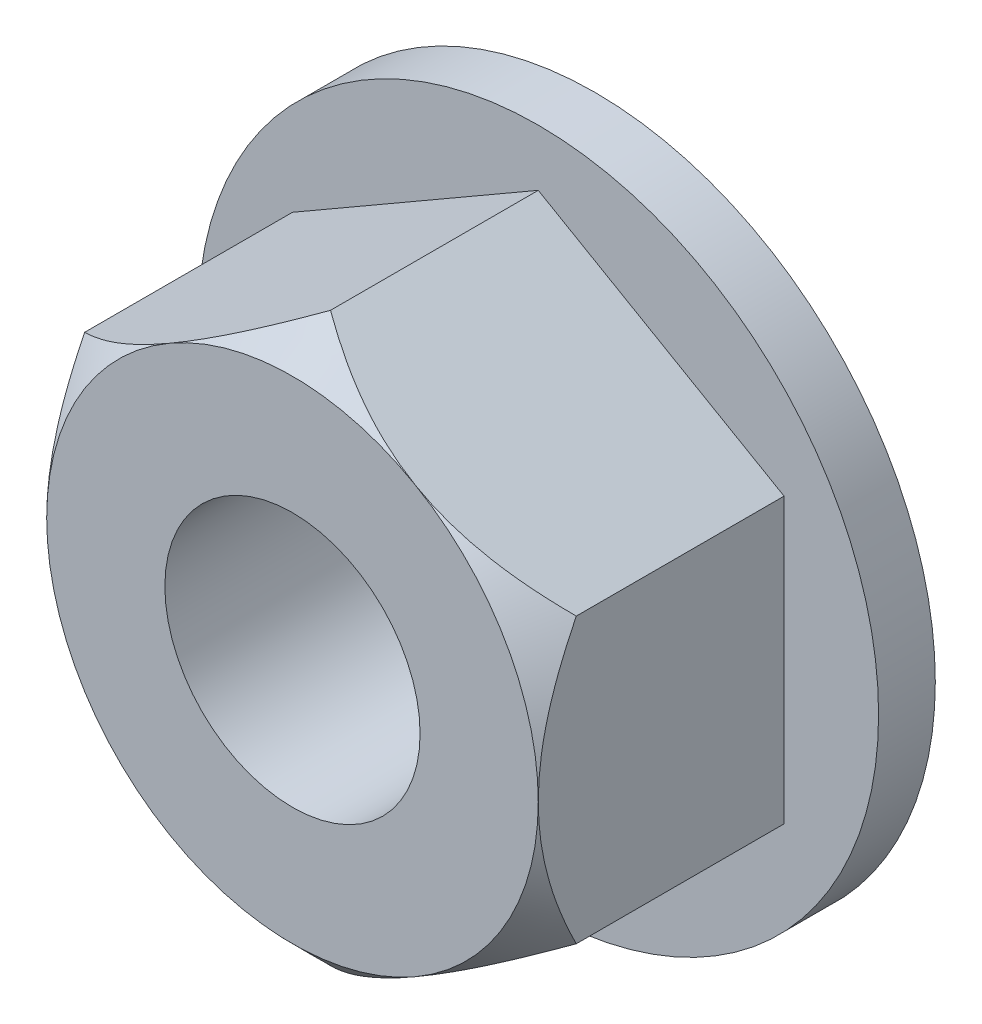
ISO-10303-21;
HEADER;
FILE_DESCRIPTION(('STEP AP214'),'2;1');
FILE_NAME('part.step','',(''),(''),'','','');
FILE_SCHEMA(('AUTOMOTIVE_DESIGN { 1 0 10303 214 1 1 1 1 }'));
ENDSEC;
DATA;
#1=APPLICATION_CONTEXT('core data for automotive mechanical design processes');
#2=APPLICATION_PROTOCOL_DEFINITION('international standard','automotive_design',2000,#1);
#3=PRODUCT_CONTEXT('',#1,'mechanical');
#4=PRODUCT('Part','Part','',(#3));
#5=PRODUCT_RELATED_PRODUCT_CATEGORY('part','',(#4));
#6=PRODUCT_DEFINITION_FORMATION('','',#4);
#7=PRODUCT_DEFINITION_CONTEXT('part definition',#1,'design');
#8=PRODUCT_DEFINITION('design','',#6,#7);
#9=PRODUCT_DEFINITION_SHAPE('','',#8);
#10=(LENGTH_UNIT() NAMED_UNIT(*) SI_UNIT(.MILLI.,.METRE.));
#11=(NAMED_UNIT(*) PLANE_ANGLE_UNIT() SI_UNIT($,.RADIAN.));
#12=(NAMED_UNIT(*) SI_UNIT($,.STERADIAN.) SOLID_ANGLE_UNIT());
#13=UNCERTAINTY_MEASURE_WITH_UNIT(LENGTH_MEASURE(1.E-05),#10,'distance_accuracy_value','');
#14=(GEOMETRIC_REPRESENTATION_CONTEXT(3) GLOBAL_UNCERTAINTY_ASSIGNED_CONTEXT((#13)) GLOBAL_UNIT_ASSIGNED_CONTEXT((#10,
#11,#12)) REPRESENTATION_CONTEXT('',''));
#15=CARTESIAN_POINT('',(0.,0.,0.));
#16=DIRECTION('',(0.,0.,1.));
#17=DIRECTION('',(1.,0.,0.));
#18=AXIS2_PLACEMENT_3D('',#15,#16,#17);
#19=CARTESIAN_POINT('',(-6.5,3.752776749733,0.));
#20=DIRECTION('',(-1.,0.,0.));
#21=DIRECTION('',(0.,0.,1.));
#22=AXIS2_PLACEMENT_3D('',#19,#20,#21);
#23=PLANE('',#22);
#24=DIRECTION('',(0.,0.,1.));
#25=VECTOR('',#24,1.);
#26=CARTESIAN_POINT('',(-6.49999999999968,3.75277674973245,0.));
#27=LINE('',#26,#25);
#28=CARTESIAN_POINT('',(-6.4999999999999,3.75277674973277,1.5));
#29=VERTEX_POINT('',#28);
#30=CARTESIAN_POINT('',(-6.49999996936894,3.75277676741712,6.99444651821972));
#31=VERTEX_POINT('',#30);
#32=EDGE_CURVE('E116',#29,#31,#27,.T.);
#33=ORIENTED_EDGE('',*,*,#32,.F.);
#34=DIRECTION('',(0.,1.,0.));
#35=VECTOR('',#34,1.);
#36=CARTESIAN_POINT('',(-6.5,0.,1.5));
#37=LINE('',#36,#35);
#38=CARTESIAN_POINT('',(-6.5,-3.752776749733,1.5));
#39=VERTEX_POINT('',#38);
#40=EDGE_CURVE('E94',#39,#29,#37,.T.);
#41=ORIENTED_EDGE('',*,*,#40,.F.);
#42=DIRECTION('',(0.,0.,1.));
#43=VECTOR('',#42,1.);
#44=CARTESIAN_POINT('',(-6.5,-3.752776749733,0.));
#45=LINE('',#44,#43);
#46=CARTESIAN_POINT('',(-6.5,-3.75277671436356,6.99444651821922));
#47=VERTEX_POINT('',#46);
#48=EDGE_CURVE('E101',#47,#39,#45,.F.);
#49=ORIENTED_EDGE('',*,*,#48,.F.);
#50=CARTESIAN_POINT('',(-6.5,7.14982880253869E-09,8.00000000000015));
#51=CARTESIAN_POINT('',(-6.5,-0.0998256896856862,8.00001159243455));
#52=CARTESIAN_POINT('',(-6.5,-0.199647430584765,7.99770065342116));
#53=CARTESIAN_POINT('',(-6.5,-0.399065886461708,7.98851981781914));
#54=CARTESIAN_POINT('',(-6.5,-0.498662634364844,7.981650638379));
#55=CARTESIAN_POINT('',(-6.5,-0.697271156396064,7.96345535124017));
#56=CARTESIAN_POINT('',(-6.5,-0.796283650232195,7.95213708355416));
#57=CARTESIAN_POINT('',(-6.5,-0.993718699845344,7.92520661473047));
#58=CARTESIAN_POINT('',(-6.5,-1.09214123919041,7.90959429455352));
#59=CARTESIAN_POINT('',(-6.5,-1.38331740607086,7.85714479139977));
#60=CARTESIAN_POINT('',(-6.5,-1.57502973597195,7.81440318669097));
#61=CARTESIAN_POINT('',(-6.5,-1.95477986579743,7.71490433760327));
#62=CARTESIAN_POINT('',(-6.5,-2.14281649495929,7.65814270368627));
#63=CARTESIAN_POINT('',(-6.5,-2.45034904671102,7.55441762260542));
#64=CARTESIAN_POINT('',(-6.5,-2.57101777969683,7.51087424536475));
#65=CARTESIAN_POINT('',(-6.5,-2.81058654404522,7.41924071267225));
#66=CARTESIAN_POINT('',(-6.5,-2.92948694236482,7.37115151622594));
#67=CARTESIAN_POINT('',(-6.5,-3.16678544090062,7.27041766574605));
#68=CARTESIAN_POINT('',(-6.5,-3.28516563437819,7.21773104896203));
#69=CARTESIAN_POINT('',(-6.5,-3.52022671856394,7.10870888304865));
#70=CARTESIAN_POINT('',(-6.5,-3.6369077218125,7.05237357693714));
#71=CARTESIAN_POINT('',(-6.5,-3.75277667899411,6.99444653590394));
#72=B_SPLINE_CURVE_WITH_KNOTS('',3,(#50,#51,#52,#53,#54,#55,#56,#57,#58,#59,#60,#61,#62,#63,#64,
#65,#66,#67,#68,#69,#70,#71),.UNSPECIFIED.,.F.,.F.,(4,2,2,2,2,2,2,2,2,2,4),(0.,
0.299443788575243,0.598840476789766,0.897711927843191,1.19659166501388,1.78518874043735,
2.373970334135,2.75873487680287,3.14341842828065,3.53207969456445,3.92071510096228),.UNSPECIFIED.);
#73=CARTESIAN_POINT('',(-6.49999999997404,4.76655303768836E-09,8.00000000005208));
#74=VERTEX_POINT('',#73);
#75=EDGE_CURVE('E217',#74,#47,#72,.T.);
#76=ORIENTED_EDGE('',*,*,#75,.F.);
#77=CARTESIAN_POINT('',(-6.49999996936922,3.7527767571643,6.99444648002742));
#78=CARTESIAN_POINT('',(-6.4999999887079,3.62290253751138,7.05937359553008));
#79=CARTESIAN_POINT('',(-6.49999999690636,3.49202404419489,7.12229545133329));
#80=CARTESIAN_POINT('',(-6.50000000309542,3.22805616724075,7.24351587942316));
#81=CARTESIAN_POINT('',(-6.50000000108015,3.09496555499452,7.301811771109));
#82=CARTESIAN_POINT('',(-6.49999999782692,2.6907088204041,7.46938967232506));
#83=CARTESIAN_POINT('',(-6.49999999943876,2.41609280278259,7.57057718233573));
#84=CARTESIAN_POINT('',(-6.50000000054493,1.86594467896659,7.74235706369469));
#85=CARTESIAN_POINT('',(-6.50000000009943,1.5906711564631,7.8137531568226));
#86=CARTESIAN_POINT('',(-6.49999999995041,1.1733615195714,7.89635166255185));
#87=CARTESIAN_POINT('',(-6.49999999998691,1.03369888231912,7.91978811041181));
#88=CARTESIAN_POINT('',(-6.50000000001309,0.753207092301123,7.95797759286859));
#89=CARTESIAN_POINT('',(-6.50000000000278,0.612378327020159,7.97273340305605));
#90=CARTESIAN_POINT('',(-6.49999999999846,0.392985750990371,7.98859952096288));
#91=CARTESIAN_POINT('',(-6.49999999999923,0.314637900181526,7.99286034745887));
#92=CARTESIAN_POINT('',(-6.50000000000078,0.157529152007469,7.99856780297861));
#93=CARTESIAN_POINT('',(-6.50000000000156,0.0787678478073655,8.00000321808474));
#94=CARTESIAN_POINT('',(-6.5,7.14982891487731E-09,8.00000000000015));
#95=B_SPLINE_CURVE_WITH_KNOTS('',3,(#77,#78,#79,#80,#81,#82,#83,#84,#85,#86,#87,#88,#89,#90,#91,
#92,#93,#94),.UNSPECIFIED.,.F.,.F.,(4,2,2,2,2,2,2,2,4),(0.,0.435571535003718,0.871393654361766,
1.74819661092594,2.59951689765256,3.02413779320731,3.44862284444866,3.68396840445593,
3.92024617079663),.UNSPECIFIED.);
#96=EDGE_CURVE('E298',#31,#74,#95,.T.);
#97=ORIENTED_EDGE('',*,*,#96,.F.);
#98=EDGE_LOOP('',(#33,#41,#49,#76,#97));
#99=FACE_BOUND('',#98,.T.);
#100=ADVANCED_FACE('F16',(#99),#23,.T.);
#101=CARTESIAN_POINT('',(0.,7.505553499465,0.));
#102=DIRECTION('',(-0.500000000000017,0.866025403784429,0.));
#103=DIRECTION('',(-0.866025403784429,-0.500000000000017,0.));
#104=AXIS2_PLACEMENT_3D('',#101,#102,#103);
#105=PLANE('',#104);
#106=DIRECTION('',(0.,0.,1.));
#107=VECTOR('',#106,1.);
#108=CARTESIAN_POINT('',(5.55978874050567E-13,7.50555349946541,0.));
#109=LINE('',#108,#107);
#110=CARTESIAN_POINT('',(3.87384513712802E-13,7.50555349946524,1.5));
#111=VERTEX_POINT('',#110);
#112=CARTESIAN_POINT('',(3.06313383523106E-08,7.50555348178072,6.99444651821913));
#113=VERTEX_POINT('',#112);
#114=EDGE_CURVE('E107',#111,#113,#109,.T.);
#115=ORIENTED_EDGE('',*,*,#114,.F.);
#116=DIRECTION('',(0.866025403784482,0.499999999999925,0.));
#117=VECTOR('',#116,1.);
#118=CARTESIAN_POINT('',(-6.5,3.752776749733,1.5));
#119=LINE('',#118,#117);
#120=EDGE_CURVE('E125',#29,#111,#119,.T.);
#121=ORIENTED_EDGE('',*,*,#120,.F.);
#122=ORIENTED_EDGE('',*,*,#32,.T.);
#123=CARTESIAN_POINT('',(-3.24999999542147,5.62916512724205,8.00000000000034));
#124=CARTESIAN_POINT('',(-3.33645158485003,5.5792522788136,8.00001159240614));
#125=CARTESIAN_POINT('',(-3.42289974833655,5.5293414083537,7.99770065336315));
#126=CARTESIAN_POINT('',(-3.59560119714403,5.42963218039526,7.9885198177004));
#127=CARTESIAN_POINT('',(-3.68185451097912,5.37983380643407,7.98165063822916));
#128=CARTESIAN_POINT('',(-3.85385453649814,5.28052954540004,7.96345535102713));
#129=CARTESIAN_POINT('',(-3.93960187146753,5.23102329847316,7.95213708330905));
#130=CARTESIAN_POINT('',(-4.11058564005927,5.13230577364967,7.92520661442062));
#131=CARTESIAN_POINT('',(-4.19582205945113,5.08309450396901,7.90959429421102));
#132=CARTESIAN_POINT('',(-4.44798801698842,4.93750642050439,7.85714479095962));
#133=CARTESIAN_POINT('',(-4.614015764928,4.84165025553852,7.8144031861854));
#134=CARTESIAN_POINT('',(-4.94288902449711,4.65177519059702,7.71490433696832));
#135=CARTESIAN_POINT('',(-5.10573352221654,4.55775687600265,7.65814270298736));
#136=CARTESIAN_POINT('',(-5.3720645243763,4.40399060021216,7.55441762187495));
#137=CARTESIAN_POINT('',(-5.47656671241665,4.34365623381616,7.5108742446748));
#138=CARTESIAN_POINT('',(-5.6840393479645,4.22387185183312,7.41924071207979));
#139=CARTESIAN_POINT('',(-5.78701011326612,4.16442165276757,7.37115151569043));
#140=CARTESIAN_POINT('',(-5.99251664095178,4.04577240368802,7.27041766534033));
#141=CARTESIAN_POINT('',(-6.09503689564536,3.98658230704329,7.21773104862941));
#142=CARTESIAN_POINT('',(-6.29860576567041,3.8690517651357,7.10870888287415));
#143=CARTESIAN_POINT('',(-6.39965447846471,3.81071126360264,7.05237357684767));
#144=CARTESIAN_POINT('',(-6.4999999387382,3.75277678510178,6.99444653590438));
#145=B_SPLINE_CURVE_WITH_KNOTS('',3,(#123,#124,#125,#126,#127,#128,#129,#130,#131,#132,#133,
#134,#135,#136,#137,#138,#139,#140,#141,#142,#143,#144),.UNSPECIFIED.,.F.,.F.,(4,2,2,2,2,2,2,2,
2,2,4),(0.,0.299443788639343,0.598840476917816,0.89771192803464,1.19659166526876,
1.78518874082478,2.37397033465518,2.75873487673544,3.14341842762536,3.53207969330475,
3.92071509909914),.UNSPECIFIED.);
#146=CARTESIAN_POINT('',(-3.24999999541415,5.62916512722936,8.00000000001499));
#147=VERTEX_POINT('',#146);
#148=EDGE_CURVE('E20',#147,#31,#145,.T.);
#149=ORIENTED_EDGE('',*,*,#148,.F.);
#150=CARTESIAN_POINT('',(2.17514989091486E-08,7.50555347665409,6.99444648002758));
#151=CARTESIAN_POINT('',(-0.112474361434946,7.44061638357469,7.05937359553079));
#152=CARTESIAN_POINT('',(-0.225818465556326,7.37517714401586,7.12229545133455));
#153=CARTESIAN_POINT('',(-0.454421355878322,7.24319321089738,7.24351587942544));
#154=CARTESIAN_POINT('',(-0.569681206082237,7.17664790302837,7.30181177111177));
#155=CARTESIAN_POINT('',(-0.919777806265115,6.97451953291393,7.46938967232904));
#156=CARTESIAN_POINT('',(-1.15760225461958,6.83721152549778,7.57057718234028));
#157=CARTESIAN_POINT('',(-1.63404450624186,6.56213746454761,7.74235706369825));
#158=CARTESIAN_POINT('',(-1.87243836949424,6.42450070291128,7.81375315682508));
#159=CARTESIAN_POINT('',(-2.23383911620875,6.21584588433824,7.89635166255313));
#160=CARTESIAN_POINT('',(-2.35479050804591,6.14601456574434,7.91978811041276));
#161=CARTESIAN_POINT('',(-2.59770352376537,6.00576867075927,7.95797759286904));
#162=CARTESIAN_POINT('',(-2.71966481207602,5.9353542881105,7.97273340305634));
#163=CARTESIAN_POINT('',(-2.90966435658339,5.82565799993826,7.98859952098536));
#164=CARTESIAN_POINT('',(-2.97751558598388,5.78648407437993,7.99286034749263));
#165=CARTESIAN_POINT('',(-3.11357575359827,5.70792969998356,7.99856780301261));
#166=CARTESIAN_POINT('',(-3.18178504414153,5.66854904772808,8.00000321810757));
#167=CARTESIAN_POINT('',(-3.24999999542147,5.62916512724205,8.00000000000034));
#168=B_SPLINE_CURVE_WITH_KNOTS('',3,(#150,#151,#152,#153,#154,#155,#156,#157,#158,#159,#160,
#161,#162,#163,#164,#165,#166,#167),.UNSPECIFIED.,.F.,.F.,(4,2,2,2,2,2,2,2,4),(0.,
0.435571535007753,0.871393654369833,1.74819661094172,2.59951689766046,3.0241377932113,
3.44862284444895,3.68396840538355,3.92024617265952),.UNSPECIFIED.);
#169=EDGE_CURVE('E71',#113,#147,#168,.T.);
#170=ORIENTED_EDGE('',*,*,#169,.F.);
#171=EDGE_LOOP('',(#115,#121,#122,#149,#170));
#172=FACE_BOUND('',#171,.T.);
#173=ADVANCED_FACE('F121',(#172),#105,.T.);
#174=CARTESIAN_POINT('',(6.5,3.752776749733,0.));
#175=DIRECTION('',(0.500000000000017,0.866025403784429,0.));
#176=DIRECTION('',(-0.866025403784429,0.500000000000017,0.));
#177=AXIS2_PLACEMENT_3D('',#174,#175,#176);
#178=PLANE('',#177);
#179=DIRECTION('',(0.,0.,-1.));
#180=VECTOR('',#179,1.);
#181=CARTESIAN_POINT('',(6.5,3.752776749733,0.));
#182=LINE('',#181,#180);
#183=CARTESIAN_POINT('',(6.5,3.752776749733,1.5));
#184=VERTEX_POINT('',#183);
#185=CARTESIAN_POINT('',(6.5,3.75277671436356,6.99444651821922));
#186=VERTEX_POINT('',#185);
#187=EDGE_CURVE('E115',#184,#186,#182,.F.);
#188=ORIENTED_EDGE('',*,*,#187,.F.);
#189=DIRECTION('',(0.866025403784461,-0.499999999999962,0.));
#190=VECTOR('',#189,1.);
#191=CARTESIAN_POINT('',(3.188560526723E-13,7.505553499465,1.5));
#192=LINE('',#191,#190);
#193=EDGE_CURVE('E112',#111,#184,#192,.T.);
#194=ORIENTED_EDGE('',*,*,#193,.F.);
#195=ORIENTED_EDGE('',*,*,#114,.T.);
#196=CARTESIAN_POINT('',(3.25000000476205,5.62916512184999,7.9999999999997));
#197=CARTESIAN_POINT('',(3.16354841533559,5.67907797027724,8.00001159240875));
#198=CARTESIAN_POINT('',(3.0771002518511,5.72898884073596,7.99770065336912));
#199=CARTESIAN_POINT('',(2.90439880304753,5.82869806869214,7.98851981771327));
#200=CARTESIAN_POINT('',(2.81814548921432,5.87849644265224,7.98165063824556));
#201=CARTESIAN_POINT('',(2.64614546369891,5.9778007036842,7.9634553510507));
#202=CARTESIAN_POINT('',(2.56039812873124,6.02730695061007,7.95213708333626));
#203=CARTESIAN_POINT('',(2.38941436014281,6.12602447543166,7.92520661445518));
#204=CARTESIAN_POINT('',(2.30417794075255,6.17523574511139,7.90959429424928));
#205=CARTESIAN_POINT('',(2.05201198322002,6.32082382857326,7.85714479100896));
#206=CARTESIAN_POINT('',(1.88598423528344,6.4166799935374,7.81440318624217));
#207=CARTESIAN_POINT('',(1.55711097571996,6.60655505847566,7.71490433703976));
#208=CARTESIAN_POINT('',(1.39426647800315,6.70057337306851,7.65814270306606));
#209=CARTESIAN_POINT('',(1.1279354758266,6.85433964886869,7.55441762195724));
#210=CARTESIAN_POINT('',(1.02343328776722,6.91467401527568,7.5108742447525));
#211=CARTESIAN_POINT('',(0.815960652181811,7.0344583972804,7.41924071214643));
#212=CARTESIAN_POINT('',(0.712989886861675,7.09390859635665,7.37115151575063));
#213=CARTESIAN_POINT('',(0.507483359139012,7.21255784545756,7.27041766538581));
#214=CARTESIAN_POINT('',(0.404963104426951,7.27174794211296,7.2177310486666));
#215=CARTESIAN_POINT('',(0.201394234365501,7.38927848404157,7.10870888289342));
#216=CARTESIAN_POINT('',(0.10034552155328,7.44761898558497,7.0523735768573));
#217=CARTESIAN_POINT('',(6.12621204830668E-08,7.50555346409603,6.99444653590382));
#218=B_SPLINE_CURVE_WITH_KNOTS('',3,(#196,#197,#198,#199,#200,#201,#202,#203,#204,#205,#206,
#207,#208,#209,#210,#211,#212,#213,#214,#215,#216,#217),.UNSPECIFIED.,.F.,.F.,(4,2,2,2,2,2,2,2,
2,2,4),(0.,0.299443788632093,0.598840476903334,0.897711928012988,1.19659166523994,
1.78518874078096,2.37397033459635,2.75873487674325,3.14341842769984,3.53207969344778,
3.92071509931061),.UNSPECIFIED.);
#219=CARTESIAN_POINT('',(3.25000000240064,5.62916512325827,7.9999999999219));
#220=VERTEX_POINT('',#219);
#221=EDGE_CURVE('E111',#220,#113,#218,.T.);
#222=ORIENTED_EDGE('',*,*,#221,.F.);
#223=CARTESIAN_POINT('',(6.49999999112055,3.75277671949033,6.99444648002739));
#224=CARTESIAN_POINT('',(6.38752562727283,3.81771384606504,7.05937359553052));
#225=CARTESIAN_POINT('',(6.27418153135,3.88315309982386,7.1222954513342));
#226=CARTESIAN_POINT('',(6.04557864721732,4.01513704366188,7.24351587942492));
#227=CARTESIAN_POINT('',(5.93031879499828,4.08168234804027,7.30181177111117));
#228=CARTESIAN_POINT('',(5.58022219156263,4.28381071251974,7.46938967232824));
#229=CARTESIAN_POINT('',(5.34239774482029,4.42111872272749,7.57057718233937));
#230=CARTESIAN_POINT('',(4.86595549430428,4.69619278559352,7.74235706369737));
#231=CARTESIAN_POINT('',(4.62756163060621,4.83382954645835,7.81375315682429));
#232=CARTESIAN_POINT('',(4.26616088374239,5.04248436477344,7.89635166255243));
#233=CARTESIAN_POINT('',(4.14520949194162,5.11231568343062,7.91978811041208));
#234=CARTESIAN_POINT('',(3.90229647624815,5.25256157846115,7.9579775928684));
#235=CARTESIAN_POINT('',(3.78033518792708,5.32297596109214,7.97273340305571));
#236=CARTESIAN_POINT('',(3.59033564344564,5.43267224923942,7.9885995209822));
#237=CARTESIAN_POINT('',(3.52248441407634,5.47184617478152,7.99286034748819));
#238=CARTESIAN_POINT('',(3.38642424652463,5.55040054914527,7.99856780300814));
#239=CARTESIAN_POINT('',(3.31821495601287,5.58978120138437,8.00000321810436));
#240=CARTESIAN_POINT('',(3.25000000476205,5.62916512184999,7.9999999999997));
#241=B_SPLINE_CURVE_WITH_KNOTS('',3,(#223,#224,#225,#226,#227,#228,#229,#230,#231,#232,#233,
#234,#235,#236,#237,#238,#239,#240),.UNSPECIFIED.,.F.,.F.,(4,2,2,2,2,2,2,2,4),(0.,
0.435571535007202,0.871393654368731,1.74819661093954,2.599516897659,3.0241377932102,
3.44862284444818,3.68396840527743,3.92024617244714),.UNSPECIFIED.);
#242=EDGE_CURVE('E119',#186,#220,#241,.T.);
#243=ORIENTED_EDGE('',*,*,#242,.F.);
#244=EDGE_LOOP('',(#188,#194,#195,#222,#243));
#245=FACE_BOUND('',#244,.T.);
#246=ADVANCED_FACE('F109',(#245),#178,.T.);
#247=CARTESIAN_POINT('',(6.5,-3.752776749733,0.));
#248=DIRECTION('',(1.,0.,0.));
#249=DIRECTION('',(0.,0.,-1.));
#250=AXIS2_PLACEMENT_3D('',#247,#248,#249);
#251=PLANE('',#250);
#252=DIRECTION('',(0.,0.,1.));
#253=VECTOR('',#252,1.);
#254=CARTESIAN_POINT('',(6.49999999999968,-3.75277674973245,0.));
#255=LINE('',#254,#253);
#256=CARTESIAN_POINT('',(6.49999999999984,-3.75277674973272,1.5));
#257=VERTEX_POINT('',#256);
#258=CARTESIAN_POINT('',(6.49999996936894,-3.75277676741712,6.99444651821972));
#259=VERTEX_POINT('',#258);
#260=EDGE_CURVE('E311',#257,#259,#255,.T.);
#261=ORIENTED_EDGE('',*,*,#260,.F.);
#262=DIRECTION('',(0.,1.,0.));
#263=VECTOR('',#262,1.);
#264=CARTESIAN_POINT('',(6.5,0.,1.5));
#265=LINE('',#264,#263);
#266=EDGE_CURVE('E274',#184,#257,#265,.F.);
#267=ORIENTED_EDGE('',*,*,#266,.F.);
#268=ORIENTED_EDGE('',*,*,#187,.T.);
#269=CARTESIAN_POINT('',(6.5,-9.53310216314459E-09,8.00000000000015));
#270=CARTESIAN_POINT('',(6.5,0.0998256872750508,8.00001159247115));
#271=CARTESIAN_POINT('',(6.5,0.199647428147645,7.99770065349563));
#272=CARTESIAN_POINT('',(6.5,0.399065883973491,7.98851981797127));
#273=CARTESIAN_POINT('',(6.5,0.498662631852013,7.98165063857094));
#274=CARTESIAN_POINT('',(6.5,0.697271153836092,7.96345535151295));
#275=CARTESIAN_POINT('',(6.5,0.796283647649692,7.95213708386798));
#276=CARTESIAN_POINT('',(6.5,0.993718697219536,7.92520661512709));
#277=CARTESIAN_POINT('',(6.5,1.09214123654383,7.90959429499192));
#278=CARTESIAN_POINT('',(6.5,1.38331740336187,7.85714479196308));
#279=CARTESIAN_POINT('',(6.5,1.57502973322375,7.81440318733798));
#280=CARTESIAN_POINT('',(6.5,1.95477986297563,7.7149043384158));
#281=CARTESIAN_POINT('',(6.5,2.14281649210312,7.65814270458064));
#282=CARTESIAN_POINT('',(6.5,2.45034904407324,7.55441762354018));
#283=CARTESIAN_POINT('',(6.5,2.57101777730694,7.51087424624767));
#284=CARTESIAN_POINT('',(6.5,2.81058654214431,7.41924071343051));
#285=CARTESIAN_POINT('',(6.5,2.92948694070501,7.37115151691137));
#286=CARTESIAN_POINT('',(6.5,3.16678543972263,7.27041766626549));
#287=CARTESIAN_POINT('',(6.5,3.28516563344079,7.217731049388));
#288=CARTESIAN_POINT('',(6.5,3.52022671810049,7.10870888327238));
#289=CARTESIAN_POINT('',(6.5,3.63690772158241,7.05237357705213));
#290=CARTESIAN_POINT('',(6.5,3.75277667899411,6.99444653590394));
#291=B_SPLINE_CURVE_WITH_KNOTS('',3,(#269,#270,#271,#272,#273,#274,#275,#276,#277,#278,#279,
#280,#281,#282,#283,#284,#285,#286,#287,#288,#289,#290),.UNSPECIFIED.,.F.,.F.,(4,2,2,2,2,2,2,2,
2,2,4),(0.,0.299443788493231,0.598840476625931,0.897711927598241,1.19659166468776,
1.78518873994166,2.37397033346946,2.75873487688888,3.14341842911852,3.53207969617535,
3.92071510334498),.UNSPECIFIED.);
#292=CARTESIAN_POINT('',(6.5,-4.76655108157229E-09,8.00000000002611));
#293=VERTEX_POINT('',#292);
#294=EDGE_CURVE('E158',#293,#186,#291,.T.);
#295=ORIENTED_EDGE('',*,*,#294,.F.);
#296=CARTESIAN_POINT('',(6.49999996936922,-3.7527767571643,6.99444648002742));
#297=CARTESIAN_POINT('',(6.4999999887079,-3.62290253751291,7.05937359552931));
#298=CARTESIAN_POINT('',(6.49999999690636,-3.49202404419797,7.12229545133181));
#299=CARTESIAN_POINT('',(6.50000000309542,-3.22805616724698,7.24351587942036));
#300=CARTESIAN_POINT('',(6.50000000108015,-3.09496555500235,7.30181177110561));
#301=CARTESIAN_POINT('',(6.49999999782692,-2.69070882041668,7.46938967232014));
#302=CARTESIAN_POINT('',(6.49999999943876,-2.41609280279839,7.57057718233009));
#303=CARTESIAN_POINT('',(6.50000000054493,-1.86594467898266,7.74235706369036));
#304=CARTESIAN_POINT('',(6.50000000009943,-1.59067115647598,7.81375315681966));
#305=CARTESIAN_POINT('',(6.49999999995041,-1.17336151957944,7.89635166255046));
#306=CARTESIAN_POINT('',(6.49999999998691,-1.03369888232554,7.91978811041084));
#307=CARTESIAN_POINT('',(6.50000000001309,-0.753207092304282,7.95797759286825));
#308=CARTESIAN_POINT('',(6.50000000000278,-0.612378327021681,7.97273340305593));
#309=CARTESIAN_POINT('',(6.49999999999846,-0.39298575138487,7.98859952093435));
#310=CARTESIAN_POINT('',(6.49999999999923,-0.314637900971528,7.99286034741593));
#311=CARTESIAN_POINT('',(6.50000000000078,-0.15752915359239,7.99856780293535));
#312=CARTESIAN_POINT('',(6.50000000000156,-0.0787678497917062,8.00000321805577));
#313=CARTESIAN_POINT('',(6.5,-9.53310229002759E-09,8.00000000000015));
#314=B_SPLINE_CURVE_WITH_KNOTS('',3,(#296,#297,#298,#299,#300,#301,#302,#303,#304,#305,#306,
#307,#308,#309,#310,#311,#312,#313),.UNSPECIFIED.,.F.,.F.,(4,2,2,2,2,2,2,2,4),(0.,
0.435571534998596,0.871393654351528,1.74819661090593,2.59951689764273,3.02413779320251,
3.44862284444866,3.68396840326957,3.92024616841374),.UNSPECIFIED.);
#315=EDGE_CURVE('E178',#259,#293,#314,.T.);
#316=ORIENTED_EDGE('',*,*,#315,.F.);
#317=EDGE_LOOP('',(#261,#267,#268,#295,#316));
#318=FACE_BOUND('',#317,.T.);
#319=ADVANCED_FACE('F150',(#318),#251,.T.);
#320=CARTESIAN_POINT('',(0.,-7.505553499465,0.));
#321=DIRECTION('',(0.500000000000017,-0.866025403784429,0.));
#322=DIRECTION('',(0.866025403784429,0.500000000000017,0.));
#323=AXIS2_PLACEMENT_3D('',#320,#321,#322);
#324=PLANE('',#323);
#325=DIRECTION('',(0.,0.,1.));
#326=VECTOR('',#325,1.);
#327=CARTESIAN_POINT('',(-5.55978874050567E-13,-7.50555349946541,0.));
#328=LINE('',#327,#326);
#329=CARTESIAN_POINT('',(-3.87412788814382E-13,-7.50555349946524,1.5));
#330=VERTEX_POINT('',#329);
#331=CARTESIAN_POINT('',(-3.06310459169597E-08,-7.50555348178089,6.99444651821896));
#332=VERTEX_POINT('',#331);
#333=EDGE_CURVE('E302',#330,#332,#328,.T.);
#334=ORIENTED_EDGE('',*,*,#333,.F.);
#335=DIRECTION('',(-0.866025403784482,-0.499999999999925,0.));
#336=VECTOR('',#335,1.);
#337=CARTESIAN_POINT('',(6.5,-3.752776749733,1.5));
#338=LINE('',#337,#336);
#339=EDGE_CURVE('E80',#257,#330,#338,.T.);
#340=ORIENTED_EDGE('',*,*,#339,.F.);
#341=ORIENTED_EDGE('',*,*,#260,.T.);
#342=CARTESIAN_POINT('',(3.24999999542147,-5.62916512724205,8.00000000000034));
#343=CARTESIAN_POINT('',(3.33645158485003,-5.57925227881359,8.00001159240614));
#344=CARTESIAN_POINT('',(3.42289974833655,-5.5293414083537,7.99770065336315));
#345=CARTESIAN_POINT('',(3.59560119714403,-5.42963218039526,7.9885198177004));
#346=CARTESIAN_POINT('',(3.68185451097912,-5.37983380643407,7.98165063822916));
#347=CARTESIAN_POINT('',(3.85385453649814,-5.28052954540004,7.96345535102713));
#348=CARTESIAN_POINT('',(3.93960187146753,-5.23102329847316,7.95213708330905));
#349=CARTESIAN_POINT('',(4.11058564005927,-5.13230577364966,7.92520661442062));
#350=CARTESIAN_POINT('',(4.19582205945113,-5.08309450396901,7.90959429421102));
#351=CARTESIAN_POINT('',(4.44798801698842,-4.93750642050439,7.85714479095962));
#352=CARTESIAN_POINT('',(4.614015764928,-4.84165025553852,7.8144031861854));
#353=CARTESIAN_POINT('',(4.94288902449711,-4.65177519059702,7.71490433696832));
#354=CARTESIAN_POINT('',(5.10573352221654,-4.55775687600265,7.65814270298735));
#355=CARTESIAN_POINT('',(5.37206452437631,-4.40399060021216,7.55441762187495));
#356=CARTESIAN_POINT('',(5.47656671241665,-4.34365623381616,7.5108742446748));
#357=CARTESIAN_POINT('',(5.6840393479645,-4.22387185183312,7.41924071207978));
#358=CARTESIAN_POINT('',(5.78701011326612,-4.16442165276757,7.37115151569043));
#359=CARTESIAN_POINT('',(5.99251664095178,-4.04577240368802,7.27041766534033));
#360=CARTESIAN_POINT('',(6.09503689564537,-3.98658230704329,7.21773104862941));
#361=CARTESIAN_POINT('',(6.29860576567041,-3.8690517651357,7.10870888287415));
#362=CARTESIAN_POINT('',(6.39965447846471,-3.81071126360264,7.05237357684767));
#363=CARTESIAN_POINT('',(6.4999999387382,-3.75277678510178,6.99444653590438));
#364=B_SPLINE_CURVE_WITH_KNOTS('',3,(#342,#343,#344,#345,#346,#347,#348,#349,#350,#351,#352,
#353,#354,#355,#356,#357,#358,#359,#360,#361,#362,#363),.UNSPECIFIED.,.F.,.F.,(4,2,2,2,2,2,2,2,
2,2,4),(0.,0.299443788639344,0.598840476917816,0.897711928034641,1.19659166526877,
1.78518874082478,2.37397033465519,2.75873487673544,3.14341842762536,3.53207969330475,
3.92071509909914),.UNSPECIFIED.);
#365=CARTESIAN_POINT('',(3.24999999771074,-5.62916512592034,8.00000000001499));
#366=VERTEX_POINT('',#365);
#367=EDGE_CURVE('E183',#366,#259,#364,.T.);
#368=ORIENTED_EDGE('',*,*,#367,.F.);
#369=CARTESIAN_POINT('',(-2.17508423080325E-08,-7.505553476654,6.99444648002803));
#370=CARTESIAN_POINT('',(0.112474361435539,-7.44061638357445,7.05937359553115));
#371=CARTESIAN_POINT('',(0.225818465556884,-7.37517714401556,7.12229545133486));
#372=CARTESIAN_POINT('',(0.454421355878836,-7.24319321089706,7.24351587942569));
#373=CARTESIAN_POINT('',(0.569681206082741,-7.17664790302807,7.30181177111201));
#374=CARTESIAN_POINT('',(0.919777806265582,-6.97451953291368,7.46938967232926));
#375=CARTESIAN_POINT('',(1.15760225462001,-6.83721152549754,7.57057718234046));
#376=CARTESIAN_POINT('',(1.63404450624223,-6.56213746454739,7.74235706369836));
#377=CARTESIAN_POINT('',(1.87243836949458,-6.42450070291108,7.81375315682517));
#378=CARTESIAN_POINT('',(2.23383911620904,-6.21584588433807,7.8963516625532));
#379=CARTESIAN_POINT('',(2.35479050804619,-6.14601456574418,7.91978811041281));
#380=CARTESIAN_POINT('',(2.59770352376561,-6.00576867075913,7.95797759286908));
#381=CARTESIAN_POINT('',(2.71966481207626,-5.93535428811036,7.97273340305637));
#382=CARTESIAN_POINT('',(2.90966435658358,-5.82565799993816,7.98859952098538));
#383=CARTESIAN_POINT('',(2.97751558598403,-5.78648407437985,7.99286034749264));
#384=CARTESIAN_POINT('',(3.11357575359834,-5.70792969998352,7.99856780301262));
#385=CARTESIAN_POINT('',(3.18178504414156,-5.66854904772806,8.00000321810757));
#386=CARTESIAN_POINT('',(3.24999999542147,-5.62916512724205,8.00000000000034));
#387=B_SPLINE_CURVE_WITH_KNOTS('',3,(#369,#370,#371,#372,#373,#374,#375,#376,#377,#378,#379,
#380,#381,#382,#383,#384,#385,#386),.UNSPECIFIED.,.F.,.F.,(4,2,2,2,2,2,2,2,4),(0.,
0.435571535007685,0.8713936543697,1.74819661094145,2.59951689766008,3.02413779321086,
3.44862284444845,3.68396840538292,3.92024617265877),.UNSPECIFIED.);
#388=EDGE_CURVE('E189',#332,#366,#387,.T.);
#389=ORIENTED_EDGE('',*,*,#388,.F.);
#390=EDGE_LOOP('',(#334,#340,#341,#368,#389));
#391=FACE_BOUND('',#390,.T.);
#392=ADVANCED_FACE('F194',(#391),#324,.T.);
#393=CARTESIAN_POINT('',(-6.5,-3.752776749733,0.));
#394=DIRECTION('',(-0.500000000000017,-0.866025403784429,0.));
#395=DIRECTION('',(0.866025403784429,-0.500000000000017,0.));
#396=AXIS2_PLACEMENT_3D('',#393,#394,#395);
#397=PLANE('',#396);
#398=ORIENTED_EDGE('',*,*,#48,.T.);
#399=DIRECTION('',(-0.866025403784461,0.499999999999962,0.));
#400=VECTOR('',#399,1.);
#401=CARTESIAN_POINT('',(-3.188560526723E-13,-7.505553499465,1.5));
#402=LINE('',#401,#400);
#403=EDGE_CURVE('E270',#330,#39,#402,.T.);
#404=ORIENTED_EDGE('',*,*,#403,.F.);
#405=ORIENTED_EDGE('',*,*,#333,.T.);
#406=CARTESIAN_POINT('',(-3.25000000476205,-5.62916512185,7.9999999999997));
#407=CARTESIAN_POINT('',(-3.16354841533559,-5.67907797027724,8.00001159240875));
#408=CARTESIAN_POINT('',(-3.0771002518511,-5.72898884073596,7.99770065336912));
#409=CARTESIAN_POINT('',(-2.90439880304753,-5.82869806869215,7.98851981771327));
#410=CARTESIAN_POINT('',(-2.81814548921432,-5.87849644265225,7.98165063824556));
#411=CARTESIAN_POINT('',(-2.6461454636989,-5.9778007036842,7.9634553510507));
#412=CARTESIAN_POINT('',(-2.56039812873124,-6.02730695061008,7.95213708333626));
#413=CARTESIAN_POINT('',(-2.38941436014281,-6.12602447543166,7.92520661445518));
#414=CARTESIAN_POINT('',(-2.30417794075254,-6.1752357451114,7.90959429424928));
#415=CARTESIAN_POINT('',(-2.05201198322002,-6.32082382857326,7.85714479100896));
#416=CARTESIAN_POINT('',(-1.88598423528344,-6.4166799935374,7.81440318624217));
#417=CARTESIAN_POINT('',(-1.55711097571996,-6.60655505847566,7.71490433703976));
#418=CARTESIAN_POINT('',(-1.39426647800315,-6.70057337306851,7.65814270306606));
#419=CARTESIAN_POINT('',(-1.12793547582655,-6.85433964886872,7.55441762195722));
#420=CARTESIAN_POINT('',(-1.02343328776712,-6.91467401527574,7.51087424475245));
#421=CARTESIAN_POINT('',(-0.815960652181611,-7.03445839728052,7.41924071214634));
#422=CARTESIAN_POINT('',(-0.712989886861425,-7.09390859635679,7.37115151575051));
#423=CARTESIAN_POINT('',(-0.507483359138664,-7.21255784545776,7.27041766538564));
#424=CARTESIAN_POINT('',(-0.404963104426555,-7.27174794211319,7.2177310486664));
#425=CARTESIAN_POINT('',(-0.20139423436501,-7.38927848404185,7.10870888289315));
#426=CARTESIAN_POINT('',(-0.100345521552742,-7.44761898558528,7.05237357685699));
#427=CARTESIAN_POINT('',(-6.12615359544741E-08,-7.50555346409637,6.99444653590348));
#428=B_SPLINE_CURVE_WITH_KNOTS('',3,(#406,#407,#408,#409,#410,#411,#412,#413,#414,#415,#416,
#417,#418,#419,#420,#421,#422,#423,#424,#425,#426,#427),.UNSPECIFIED.,.F.,.F.,(4,2,2,2,2,2,2,2,
2,2,4),(0.,0.299443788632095,0.598840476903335,0.897711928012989,1.19659166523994,
1.78518874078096,2.37397033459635,2.75873487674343,3.14341842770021,3.53207969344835,
3.92071509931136),.UNSPECIFIED.);
#429=CARTESIAN_POINT('',(-3.25000000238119,-5.62916512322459,7.9999999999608));
#430=VERTEX_POINT('',#429);
#431=EDGE_CURVE('E206',#430,#332,#428,.T.);
#432=ORIENTED_EDGE('',*,*,#431,.F.);
#433=CARTESIAN_POINT('',(-6.49999999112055,-3.75277671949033,6.99444648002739));
#434=CARTESIAN_POINT('',(-6.38752562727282,-3.81771384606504,7.05937359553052));
#435=CARTESIAN_POINT('',(-6.27418153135,-3.88315309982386,7.1222954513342));
#436=CARTESIAN_POINT('',(-6.04557864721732,-4.01513704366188,7.24351587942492));
#437=CARTESIAN_POINT('',(-5.93031879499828,-4.08168234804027,7.30181177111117));
#438=CARTESIAN_POINT('',(-5.58022219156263,-4.28381071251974,7.46938967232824));
#439=CARTESIAN_POINT('',(-5.34239774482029,-4.42111872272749,7.57057718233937));
#440=CARTESIAN_POINT('',(-4.86595549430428,-4.69619278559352,7.74235706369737));
#441=CARTESIAN_POINT('',(-4.62756163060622,-4.83382954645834,7.81375315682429));
#442=CARTESIAN_POINT('',(-4.26616088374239,-5.04248436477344,7.89635166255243));
#443=CARTESIAN_POINT('',(-4.14520949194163,-5.11231568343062,7.91978811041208));
#444=CARTESIAN_POINT('',(-3.90229647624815,-5.25256157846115,7.9579775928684));
#445=CARTESIAN_POINT('',(-3.78033518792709,-5.32297596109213,7.97273340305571));
#446=CARTESIAN_POINT('',(-3.59033564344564,-5.43267224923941,7.9885995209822));
#447=CARTESIAN_POINT('',(-3.52248441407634,-5.47184617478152,7.99286034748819));
#448=CARTESIAN_POINT('',(-3.38642424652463,-5.55040054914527,7.99856780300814));
#449=CARTESIAN_POINT('',(-3.31821495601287,-5.58978120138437,8.00000321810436));
#450=CARTESIAN_POINT('',(-3.25000000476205,-5.62916512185,7.9999999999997));
#451=B_SPLINE_CURVE_WITH_KNOTS('',3,(#433,#434,#435,#436,#437,#438,#439,#440,#441,#442,#443,
#444,#445,#446,#447,#448,#449,#450),.UNSPECIFIED.,.F.,.F.,(4,2,2,2,2,2,2,2,4),(0.,
0.435571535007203,0.87139365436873,1.74819661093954,2.599516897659,3.0241377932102,
3.44862284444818,3.68396840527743,3.92024617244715),.UNSPECIFIED.);
#452=EDGE_CURVE('E211',#47,#430,#451,.T.);
#453=ORIENTED_EDGE('',*,*,#452,.F.);
#454=EDGE_LOOP('',(#398,#404,#405,#432,#453));
#455=FACE_BOUND('',#454,.T.);
#456=ADVANCED_FACE('F198',(#455),#397,.T.);
#457=CARTESIAN_POINT('',(0.,0.,6.98841317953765));
#458=DIRECTION('',(0.,0.,-1.));
#459=DIRECTION('',(-1.,0.,0.));
#460=AXIS2_PLACEMENT_3D('',#457,#458,#459);
#461=CONICAL_SURFACE('',#460,7.5115868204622,0.7853981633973);
#462=ORIENTED_EDGE('',*,*,#96,.T.);
#463=CARTESIAN_POINT('',(0.,0.,8.00000000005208));
#464=DIRECTION('',(0.,0.,-1.));
#465=DIRECTION('',(-1.,0.,0.));
#466=AXIS2_PLACEMENT_3D('',#463,#464,#465);
#467=CIRCLE('',#466,6.49999999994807);
#468=EDGE_CURVE('E132',#147,#74,#467,.F.);
#469=ORIENTED_EDGE('',*,*,#468,.F.);
#470=ORIENTED_EDGE('',*,*,#148,.T.);
#471=EDGE_LOOP('',(#462,#469,#470));
#472=FACE_BOUND('',#471,.T.);
#473=ADVANCED_FACE('F203',(#472),#461,.T.);
#474=CARTESIAN_POINT('',(0.,0.,6.98841317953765));
#475=DIRECTION('',(0.,0.,-1.));
#476=DIRECTION('',(-1.,0.,0.));
#477=AXIS2_PLACEMENT_3D('',#474,#475,#476);
#478=CONICAL_SURFACE('',#477,7.5115868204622,0.7853981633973);
#479=ORIENTED_EDGE('',*,*,#452,.T.);
#480=CARTESIAN_POINT('',(0.,0.,7.9999999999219));
#481=DIRECTION('',(0.,0.,-1.));
#482=DIRECTION('',(-1.,0.,0.));
#483=AXIS2_PLACEMENT_3D('',#480,#481,#482);
#484=CIRCLE('',#483,6.50000000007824);
#485=EDGE_CURVE('E264',#74,#430,#484,.F.);
#486=ORIENTED_EDGE('',*,*,#485,.F.);
#487=ORIENTED_EDGE('',*,*,#75,.T.);
#488=EDGE_LOOP('',(#479,#486,#487));
#489=FACE_BOUND('',#488,.T.);
#490=ADVANCED_FACE('F221',(#489),#478,.T.);
#491=CARTESIAN_POINT('',(0.,0.,6.98841317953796));
#492=DIRECTION('',(0.,0.,-1.));
#493=DIRECTION('',(-1.,0.,0.));
#494=AXIS2_PLACEMENT_3D('',#491,#492,#493);
#495=CONICAL_SURFACE('',#494,7.51158682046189,0.7853981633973);
#496=CARTESIAN_POINT('',(0.,0.,8.00000000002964));
#497=DIRECTION('',(0.,0.,-1.));
#498=DIRECTION('',(-1.,0.,0.));
#499=AXIS2_PLACEMENT_3D('',#496,#497,#498);
#500=CIRCLE('',#499,6.49999999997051);
#501=EDGE_CURVE('E262',#430,#366,#500,.F.);
#502=ORIENTED_EDGE('',*,*,#501,.F.);
#503=ORIENTED_EDGE('',*,*,#431,.T.);
#504=ORIENTED_EDGE('',*,*,#388,.T.);
#505=EDGE_LOOP('',(#502,#503,#504));
#506=FACE_BOUND('',#505,.T.);
#507=ADVANCED_FACE('F173',(#506),#495,.T.);
#508=CARTESIAN_POINT('',(0.,0.,6.98841317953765));
#509=DIRECTION('',(0.,0.,-1.));
#510=DIRECTION('',(-1.,0.,0.));
#511=AXIS2_PLACEMENT_3D('',#508,#509,#510);
#512=CONICAL_SURFACE('',#511,7.5115868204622,0.7853981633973);
#513=ORIENTED_EDGE('',*,*,#315,.T.);
#514=CARTESIAN_POINT('',(0.,0.,8.00000000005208));
#515=DIRECTION('',(0.,0.,-1.));
#516=DIRECTION('',(-1.,0.,0.));
#517=AXIS2_PLACEMENT_3D('',#514,#515,#516);
#518=CIRCLE('',#517,6.49999999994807);
#519=EDGE_CURVE('E259',#366,#293,#518,.F.);
#520=ORIENTED_EDGE('',*,*,#519,.F.);
#521=ORIENTED_EDGE('',*,*,#367,.T.);
#522=EDGE_LOOP('',(#513,#520,#521));
#523=FACE_BOUND('',#522,.T.);
#524=ADVANCED_FACE('F167',(#523),#512,.T.);
#525=CARTESIAN_POINT('',(0.,0.,6.98841317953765));
#526=DIRECTION('',(0.,0.,-1.));
#527=DIRECTION('',(-1.,0.,0.));
#528=AXIS2_PLACEMENT_3D('',#525,#526,#527);
#529=CONICAL_SURFACE('',#528,7.5115868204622,0.7853981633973);
#530=ORIENTED_EDGE('',*,*,#242,.T.);
#531=CARTESIAN_POINT('',(0.,0.,7.9999999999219));
#532=DIRECTION('',(0.,0.,-1.));
#533=DIRECTION('',(-1.,0.,0.));
#534=AXIS2_PLACEMENT_3D('',#531,#532,#533);
#535=CIRCLE('',#534,6.50000000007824);
#536=EDGE_CURVE('E256',#293,#220,#535,.F.);
#537=ORIENTED_EDGE('',*,*,#536,.F.);
#538=ORIENTED_EDGE('',*,*,#294,.T.);
#539=EDGE_LOOP('',(#530,#537,#538));
#540=FACE_BOUND('',#539,.T.);
#541=ADVANCED_FACE('F163',(#540),#529,.T.);
#542=CARTESIAN_POINT('',(0.,0.,6.98841317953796));
#543=DIRECTION('',(0.,0.,-1.));
#544=DIRECTION('',(-1.,0.,0.));
#545=AXIS2_PLACEMENT_3D('',#542,#543,#544);
#546=CONICAL_SURFACE('',#545,7.51158682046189,0.7853981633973);
#547=CARTESIAN_POINT('',(0.,0.,8.00000000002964));
#548=DIRECTION('',(0.,0.,-1.));
#549=DIRECTION('',(-1.,0.,0.));
#550=AXIS2_PLACEMENT_3D('',#547,#548,#549);
#551=CIRCLE('',#550,6.49999999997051);
#552=EDGE_CURVE('E40',#220,#147,#551,.F.);
#553=ORIENTED_EDGE('',*,*,#552,.F.);
#554=ORIENTED_EDGE('',*,*,#221,.T.);
#555=ORIENTED_EDGE('',*,*,#169,.T.);
#556=EDGE_LOOP('',(#553,#554,#555));
#557=FACE_BOUND('',#556,.T.);
#558=ADVANCED_FACE('F118',(#557),#546,.T.);
#559=CARTESIAN_POINT('',(0.,0.,1.5));
#560=DIRECTION('',(0.,0.,1.));
#561=DIRECTION('',(1.,0.,0.));
#562=AXIS2_PLACEMENT_3D('',#559,#560,#561);
#563=PLANE('',#562);
#564=ORIENTED_EDGE('',*,*,#339,.T.);
#565=ORIENTED_EDGE('',*,*,#403,.T.);
#566=ORIENTED_EDGE('',*,*,#40,.T.);
#567=ORIENTED_EDGE('',*,*,#120,.T.);
#568=ORIENTED_EDGE('',*,*,#193,.T.);
#569=ORIENTED_EDGE('',*,*,#266,.T.);
#570=EDGE_LOOP('',(#564,#565,#566,#567,#568,#569));
#571=FACE_BOUND('',#570,.T.);
#572=CARTESIAN_POINT('',(0.,0.,1.5));
#573=DIRECTION('',(0.,0.,1.));
#574=DIRECTION('',(1.,0.,0.));
#575=AXIS2_PLACEMENT_3D('',#572,#573,#574);
#576=CIRCLE('',#575,9.);
#577=CARTESIAN_POINT('',(9.,0.,1.5));
#578=VERTEX_POINT('',#577);
#579=EDGE_CURVE('E249',#578,#578,#576,.F.);
#580=ORIENTED_EDGE('',*,*,#579,.F.);
#581=EDGE_LOOP('',(#580));
#582=FACE_BOUND('',#581,.T.);
#583=ADVANCED_FACE('F293',(#571,#582),#563,.T.);
#584=CARTESIAN_POINT('',(0.,0.,8.));
#585=DIRECTION('',(0.,0.,1.));
#586=DIRECTION('',(1.,0.,0.));
#587=AXIS2_PLACEMENT_3D('',#584,#585,#586);
#588=PLANE('',#587);
#589=CARTESIAN_POINT('',(0.,0.,8.));
#590=DIRECTION('',(0.,0.,1.));
#591=DIRECTION('',(1.,0.,0.));
#592=AXIS2_PLACEMENT_3D('',#589,#590,#591);
#593=CIRCLE('',#592,3.375);
#594=CARTESIAN_POINT('',(3.375,0.,8.));
#595=VERTEX_POINT('',#594);
#596=EDGE_CURVE('E246',#595,#595,#593,.F.);
#597=ORIENTED_EDGE('',*,*,#596,.T.);
#598=EDGE_LOOP('',(#597));
#599=FACE_BOUND('',#598,.T.);
#600=ORIENTED_EDGE('',*,*,#536,.T.);
#601=ORIENTED_EDGE('',*,*,#552,.T.);
#602=ORIENTED_EDGE('',*,*,#468,.T.);
#603=ORIENTED_EDGE('',*,*,#485,.T.);
#604=ORIENTED_EDGE('',*,*,#501,.T.);
#605=ORIENTED_EDGE('',*,*,#519,.T.);
#606=EDGE_LOOP('',(#600,#601,#602,#603,#604,#605));
#607=FACE_BOUND('',#606,.T.);
#608=ADVANCED_FACE('F307',(#599,#607),#588,.T.);
#609=CARTESIAN_POINT('',(0.,0.,0.));
#610=DIRECTION('',(0.,0.,1.));
#611=DIRECTION('',(1.,0.,0.));
#612=AXIS2_PLACEMENT_3D('',#609,#610,#611);
#613=CYLINDRICAL_SURFACE('',#612,9.);
#614=ORIENTED_EDGE('',*,*,#579,.T.);
#615=EDGE_LOOP('',(#614));
#616=FACE_BOUND('',#615,.T.);
#617=CARTESIAN_POINT('',(0.,0.,0.));
#618=DIRECTION('',(0.,0.,1.));
#619=DIRECTION('',(1.,0.,0.));
#620=AXIS2_PLACEMENT_3D('',#617,#618,#619);
#621=CIRCLE('',#620,9.);
#622=CARTESIAN_POINT('',(9.,0.,0.));
#623=VERTEX_POINT('',#622);
#624=EDGE_CURVE('E31',#623,#623,#621,.T.);
#625=ORIENTED_EDGE('',*,*,#624,.T.);
#626=EDGE_LOOP('',(#625));
#627=FACE_BOUND('',#626,.T.);
#628=ADVANCED_FACE('F239',(#616,#627),#613,.T.);
#629=CARTESIAN_POINT('',(0.,0.,0.));
#630=DIRECTION('',(0.,0.,1.));
#631=DIRECTION('',(1.,0.,0.));
#632=AXIS2_PLACEMENT_3D('',#629,#630,#631);
#633=CYLINDRICAL_SURFACE('',#632,3.375);
#634=ORIENTED_EDGE('',*,*,#596,.F.);
#635=EDGE_LOOP('',(#634));
#636=FACE_BOUND('',#635,.T.);
#637=CARTESIAN_POINT('',(0.,0.,0.));
#638=DIRECTION('',(0.,0.,1.));
#639=DIRECTION('',(1.,0.,0.));
#640=AXIS2_PLACEMENT_3D('',#637,#638,#639);
#641=CIRCLE('',#640,3.375);
#642=CARTESIAN_POINT('',(3.375,0.,0.));
#643=VERTEX_POINT('',#642);
#644=EDGE_CURVE('E11',#643,#643,#641,.F.);
#645=ORIENTED_EDGE('',*,*,#644,.T.);
#646=EDGE_LOOP('',(#645));
#647=FACE_BOUND('',#646,.T.);
#648=ADVANCED_FACE('F234',(#636,#647),#633,.F.);
#649=CARTESIAN_POINT('',(0.,0.,0.));
#650=DIRECTION('',(0.,0.,1.));
#651=DIRECTION('',(1.,0.,0.));
#652=AXIS2_PLACEMENT_3D('',#649,#650,#651);
#653=PLANE('',#652);
#654=ORIENTED_EDGE('',*,*,#644,.F.);
#655=EDGE_LOOP('',(#654));
#656=FACE_BOUND('',#655,.T.);
#657=ORIENTED_EDGE('',*,*,#624,.F.);
#658=EDGE_LOOP('',(#657));
#659=FACE_BOUND('',#658,.T.);
#660=ADVANCED_FACE('F18',(#656,#659),#653,.F.);
#661=CLOSED_SHELL('',(#100,#173,#246,#319,#392,#456,#473,#490,#507,#524,#541,#558,#583,#608,
#628,#648,#660));
#662=MANIFOLD_SOLID_BREP('B1',#661);
#663=ADVANCED_BREP_SHAPE_REPRESENTATION('',(#18,#662),#14);
#664=SHAPE_DEFINITION_REPRESENTATION(#9,#663);
ENDSEC;
END-ISO-10303-21;
